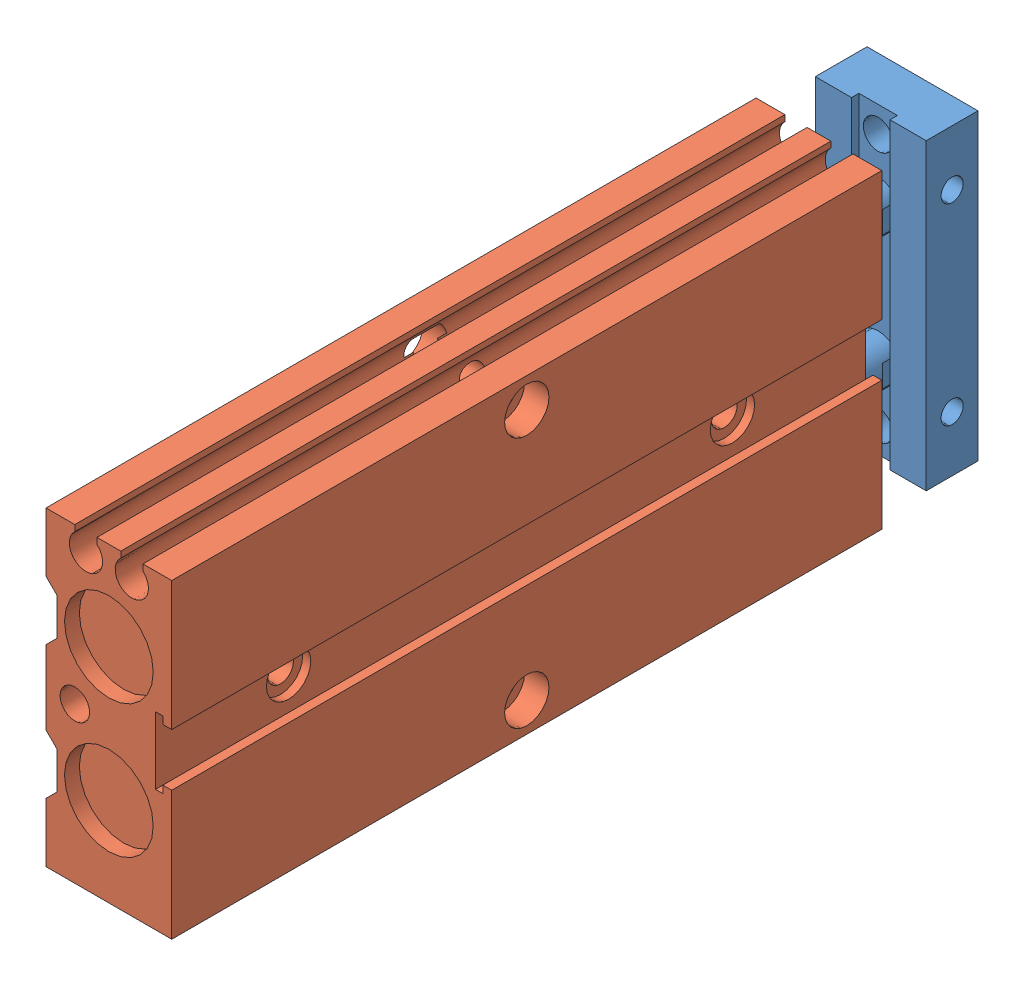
SolidWorks assembly TD.SLDASM, configuration 默认 (file format 8000). Lengths in mm.
Overall size (17 42 110).
2 component instances, 2 part files, 3 mates.
Components (placement in the parent):
- TD10X50-1: TD10X50.SLDPRT [默认] at (-17.5784 15.271 -13.6487) size (15 41 64)
- 复件 TD10X50-2-1: 复件 TD10X50-2.SLDPRT [默认] at (-17.5784 15.271 -63.6487) size (17 42 102)
Mates (geometry in assembly coordinates):
- 同心1: concentric aligned: cylinder of TD10X50-1 through (-17.5784 24.271 -7.6487) axis (0 0 1) radius 3; cylinder of 复件 TD10X50-2-1 through (-17.5784 24.271 0.3513) axis (0 0 1) radius 6
- LimitDistance1: limit distance anti-aligned: plane of TD10X50-1 through (-22.1784 15.271 -5.6487) normal (0 0 1); plane of 复件 TD10X50-2-1 through (-22.1784 15.271 -5.6487) normal (0 0 -1)
- 同心2: concentric aligned: cylinder of TD10X50-1 through (-17.5784 6.271 -7.6487) axis (0 0 1) radius 3; cylinder of 复件 TD10X50-2-1 through (-17.5784 6.271 0.3513) axis (0 0 1) radius 6
